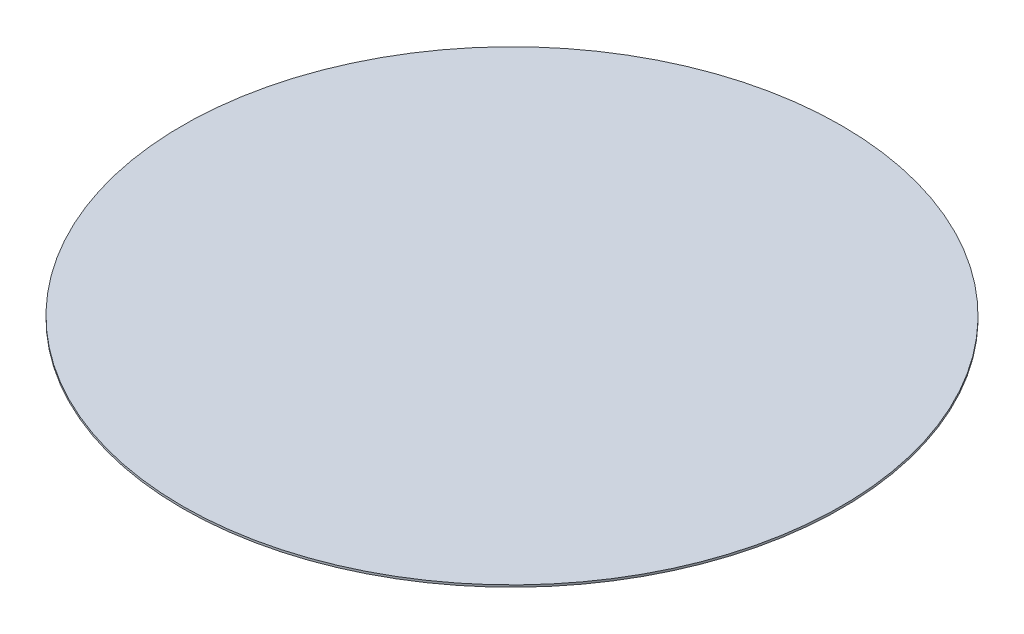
ISO-10303-21;
HEADER;
FILE_DESCRIPTION(('STEP AP214'),'2;1');
FILE_NAME('part.step','',(''),(''),'','','');
FILE_SCHEMA(('AUTOMOTIVE_DESIGN { 1 0 10303 214 1 1 1 1 }'));
ENDSEC;
DATA;
#1=APPLICATION_CONTEXT('core data for automotive mechanical design processes');
#2=APPLICATION_PROTOCOL_DEFINITION('international standard','automotive_design',2000,#1);
#3=PRODUCT_CONTEXT('',#1,'mechanical');
#4=PRODUCT('Part','Part','',(#3));
#5=PRODUCT_RELATED_PRODUCT_CATEGORY('part','',(#4));
#6=PRODUCT_DEFINITION_FORMATION('','',#4);
#7=PRODUCT_DEFINITION_CONTEXT('part definition',#1,'design');
#8=PRODUCT_DEFINITION('design','',#6,#7);
#9=PRODUCT_DEFINITION_SHAPE('','',#8);
#10=(LENGTH_UNIT() NAMED_UNIT(*) SI_UNIT(.MILLI.,.METRE.));
#11=(NAMED_UNIT(*) PLANE_ANGLE_UNIT() SI_UNIT($,.RADIAN.));
#12=(NAMED_UNIT(*) SI_UNIT($,.STERADIAN.) SOLID_ANGLE_UNIT());
#13=UNCERTAINTY_MEASURE_WITH_UNIT(LENGTH_MEASURE(1.E-05),#10,'distance_accuracy_value','');
#14=(GEOMETRIC_REPRESENTATION_CONTEXT(3) GLOBAL_UNCERTAINTY_ASSIGNED_CONTEXT((#13)) GLOBAL_UNIT_ASSIGNED_CONTEXT((#10,
#11,#12)) REPRESENTATION_CONTEXT('',''));
#15=CARTESIAN_POINT('',(0.,0.,0.));
#16=DIRECTION('',(0.,0.,1.));
#17=DIRECTION('',(1.,0.,0.));
#18=AXIS2_PLACEMENT_3D('',#15,#16,#17);
#19=CARTESIAN_POINT('',(0.,0.0500000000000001,0.));
#20=DIRECTION('',(0.,-1.,0.));
#21=DIRECTION('',(0.,0.,-1.));
#22=AXIS2_PLACEMENT_3D('',#19,#20,#21);
#23=CYLINDRICAL_SURFACE('',#22,8.);
#24=CARTESIAN_POINT('',(0.,0.0500000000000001,0.));
#25=DIRECTION('',(0.,1.,0.));
#26=DIRECTION('',(0.,0.,1.));
#27=AXIS2_PLACEMENT_3D('',#24,#25,#26);
#28=CIRCLE('',#27,8.);
#29=CARTESIAN_POINT('',(0.,0.0500000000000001,8.));
#30=VERTEX_POINT('',#29);
#31=EDGE_CURVE('E10',#30,#30,#28,.T.);
#32=ORIENTED_EDGE('',*,*,#31,.F.);
#33=EDGE_LOOP('',(#32));
#34=FACE_BOUND('',#33,.T.);
#35=CARTESIAN_POINT('',(0.,0.,0.));
#36=DIRECTION('',(0.,1.,0.));
#37=DIRECTION('',(0.,0.,1.));
#38=AXIS2_PLACEMENT_3D('',#35,#36,#37);
#39=CIRCLE('',#38,8.);
#40=CARTESIAN_POINT('',(0.,0.,8.));
#41=VERTEX_POINT('',#40);
#42=EDGE_CURVE('E31',#41,#41,#39,.T.);
#43=ORIENTED_EDGE('',*,*,#42,.T.);
#44=EDGE_LOOP('',(#43));
#45=FACE_BOUND('',#44,.T.);
#46=ADVANCED_FACE('F28',(#34,#45),#23,.T.);
#47=CARTESIAN_POINT('',(0.,0.0500000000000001,0.));
#48=DIRECTION('',(0.,1.,0.));
#49=DIRECTION('',(0.,0.,1.));
#50=AXIS2_PLACEMENT_3D('',#47,#48,#49);
#51=PLANE('',#50);
#52=ORIENTED_EDGE('',*,*,#31,.T.);
#53=EDGE_LOOP('',(#52));
#54=FACE_BOUND('',#53,.T.);
#55=ADVANCED_FACE('F43',(#54),#51,.T.);
#56=CARTESIAN_POINT('',(0.,0.,0.));
#57=DIRECTION('',(0.,1.,0.));
#58=DIRECTION('',(0.,0.,1.));
#59=AXIS2_PLACEMENT_3D('',#56,#57,#58);
#60=PLANE('',#59);
#61=ORIENTED_EDGE('',*,*,#42,.F.);
#62=EDGE_LOOP('',(#61));
#63=FACE_BOUND('',#62,.T.);
#64=ADVANCED_FACE('F41',(#63),#60,.F.);
#65=CLOSED_SHELL('',(#46,#55,#64));
#66=MANIFOLD_SOLID_BREP('B2',#65);
#67=ADVANCED_BREP_SHAPE_REPRESENTATION('',(#18,#66),#14);
#68=SHAPE_DEFINITION_REPRESENTATION(#9,#67);
ENDSEC;
END-ISO-10303-21;
